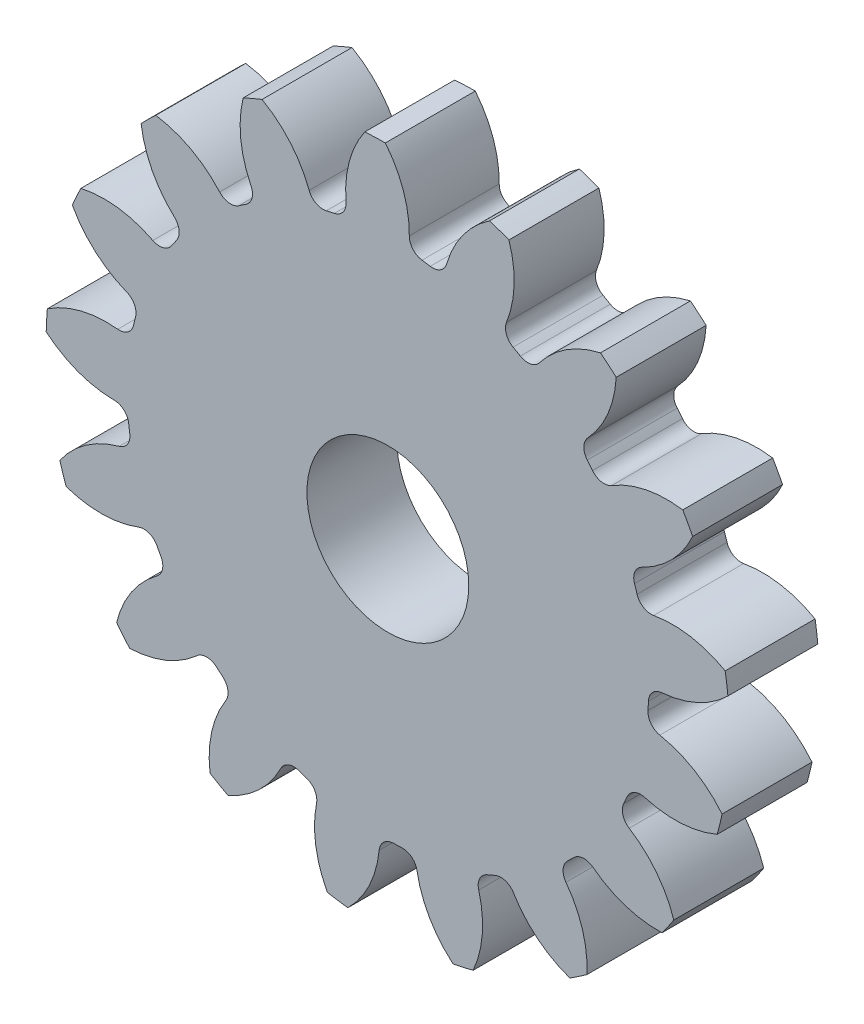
from build123d import *

# Parameters (mm, degrees)
SKETCH3_R         = 482.6
GEARBODY_DEPTH    = 127
TOOTHCUT_DEPTH    = 695.215038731
CIRPATTERN1_COUNT = 17
BOREDIA_R         = 114.3
BORE_DEPTH        = 12700


with BuildPart() as part:
    # Sketch3 → gearBody (new body)
    with BuildSketch(Plane.XY):
        Circle(SKETCH3_R)
    extrude(amount=GEARBODY_DEPTH)

    # Sketch2 → toothCut (cut, through all)
    with BuildSketch(Plane.XY):
        with BuildLine():
            ThreePointArc((367.37313155, -26.112683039), (367.74291441, -20.249417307), (368.019125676, -14.380999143))
            ThreePointArc((368.019125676, -14.380999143), (373.75706029, -0.876875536), (387.009875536, 5.419801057))
            ThreePointArc((387.009875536, 5.419801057), (438.885667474, 19.237154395), (482.6, 50.399217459))
            ThreePointArc((482.6, 50.399217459), (484.490582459, -26.678017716), (474.148718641, -103.081684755))
            ThreePointArc((474.148718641, -103.081684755), (434.120118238, -67.308395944), (384.075034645, -47.878865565))
            ThreePointArc((384.075034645, -47.878865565), (371.593687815, -40.165161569), (367.37313155, -26.112683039))
        make_face()
    toothcut = extrude(amount=TOOTHCUT_DEPTH, mode=Mode.SUBTRACT)

    # CirPattern1: toothCut ×17 about axis
    cirpattern1_axis = Axis((0, 0, 0), (0, 0, 1))
    for i in range(1, CIRPATTERN1_COUNT):
        add(toothcut.rotate(cirpattern1_axis, i * 360 / CIRPATTERN1_COUNT), mode=Mode.SUBTRACT)

    # boreDia → bore (cut, symmetric)
    with BuildSketch(Plane.XY):
        Circle(BOREDIA_R)
    extrude(amount=BORE_DEPTH, both=True, mode=Mode.SUBTRACT)


solid = part.part
